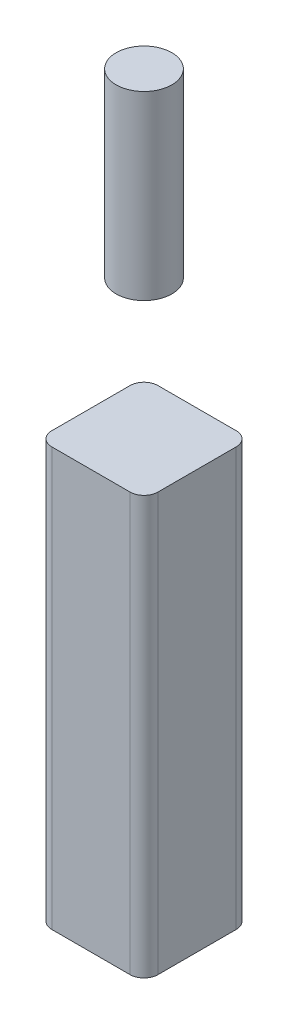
from build123d import *

# Parameters (mm, degrees)
SKETCH1_W           = 38.1
SKETCH1_H           = 38.1
BOSS_EXTRUDE1_DEPTH = 150
FILLET1_R           = 5
SKETCH2_R           = 10
BOSS_EXTRUDE2_DEPTH = 65


with BuildPart() as part:
    # Sketch1 → Boss-Extrude1 (new body)
    with BuildSketch(Plane(origin=(0, 0, 0), x_dir=(1, 0, 0), z_dir=(0, 1, 0))):
        Rectangle(SKETCH1_W, SKETCH1_H)
    extrude(amount=BOSS_EXTRUDE1_DEPTH)

    # Fillet1
    fillet1_edges = [part.edges().sort_by_distance(p)[0] for p in [
        (19.05, 75, 19.05),
        (-19.05, 75, 19.05),
        (-19.05, 75, -19.05),
        (19.05, 75, -19.05),
    ]]
    fillet(fillet1_edges, radius=FILLET1_R)


with BuildPart() as body_2:
    # Sketch2 → Boss-Extrude2 (new body)
    with BuildSketch(Plane(origin=(0, 265, 0), x_dir=(1, 0, 0), z_dir=(0, 1, 0))):
        with Locations(Location((0, 0, 0), (0, 0, 270))):
            Circle(SKETCH2_R)
    extrude(amount=-BOSS_EXTRUDE2_DEPTH)


solid = Compound([part.part, body_2.part])
